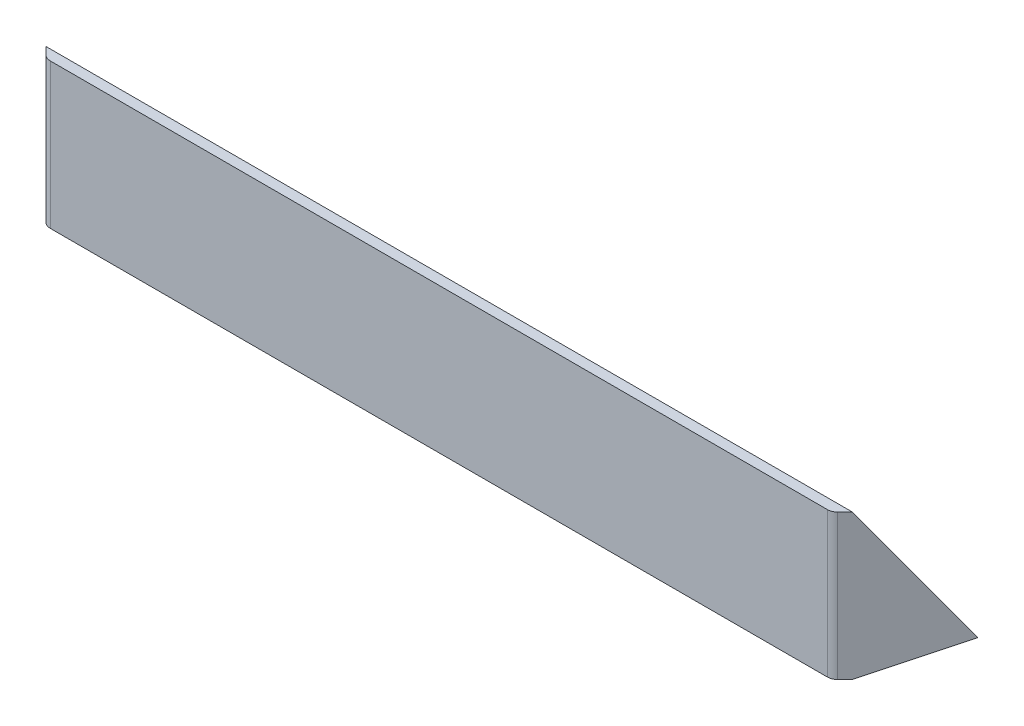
from build123d import *

# Parameters (mm, degrees)
EXTRUSION1_DEPTH             = 140
CONG_2_R                     = 10
ENL_V_MAT_EXTRU_4_DEPTH      = 484.220661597
ENL_V_MAT_EXTRU_4_DEPTH_BACK = 484.220661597


with BuildPart() as part:
    # Esquisse1 → Extrusion1 (new body)
    with BuildSketch(Plane(origin=(0, 0, 0), x_dir=(1, 0, 0), z_dir=(0, 1, 0))):
        Polygon((-379.142135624, 0), (379.142135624, 0), (455, 75.857864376), (447.928932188, 82.928932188), (375, 10), (-375, 10), (-447.928932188, 82.928932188), (-455, 75.857864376), align=None)
    extrude(amount=EXTRUSION1_DEPTH)

    # Cong_2
    cong_2_edges = [part.edges().sort_by_distance(p)[0] for p in [
        (379.142135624, 70, 0),
        (-379.142135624, 70, 0),
    ]]
    fillet(cong_2_edges, radius=CONG_2_R)

    # Esquisse5 → Enl_v. mat.-Extru.4 (cut, two sides: drawn at the far end of the back side and taken through both)
    with BuildSketch(Plane(origin=(0, 0, 0), x_dir=(0, 0, -1), z_dir=(1, 0, 0)).offset(-ENL_V_MAT_EXTRU_4_DEPTH_BACK)):
        Polygon((10, 0), (70.621778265, 35), (0.440510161, 156.557522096), (68.516171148, 195.861023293), (175.258531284, 84.203864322), (175.258531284, -80.010689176), (10, -74.671216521), align=None)
    extrude(amount=ENL_V_MAT_EXTRU_4_DEPTH + ENL_V_MAT_EXTRU_4_DEPTH_BACK, mode=Mode.SUBTRACT)


solid = part.part
